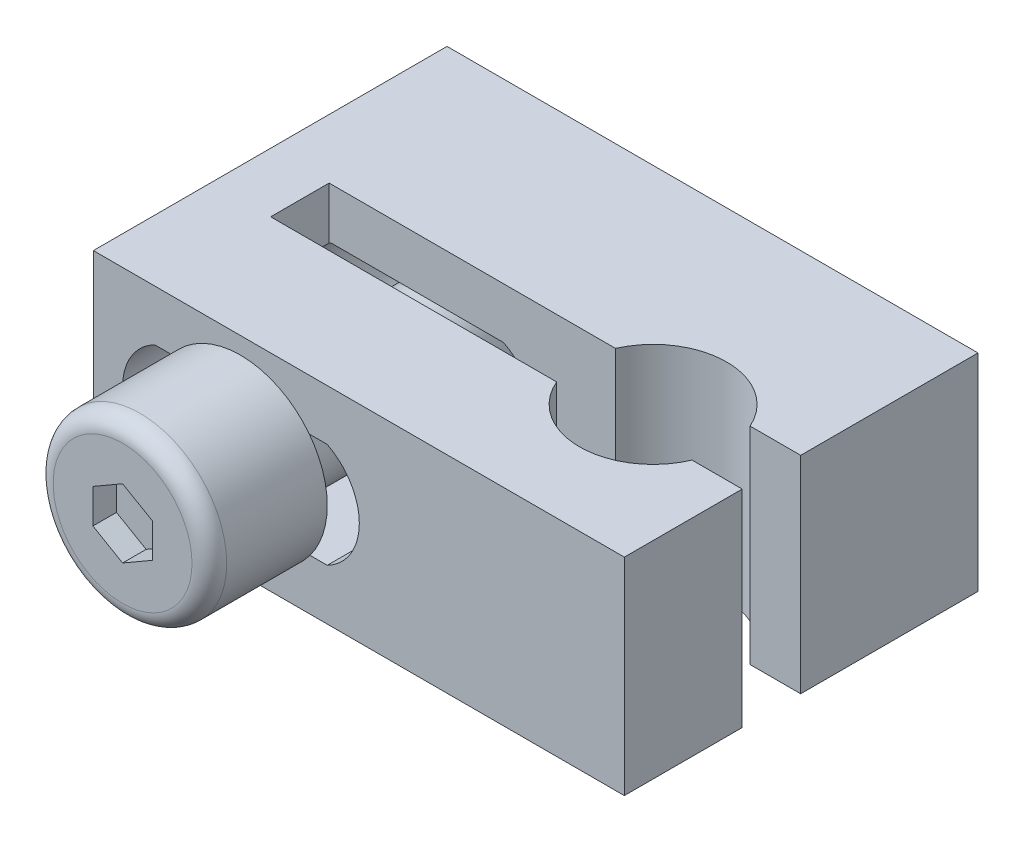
from build123d import *

# Parameters (mm, degrees)
SKETCH1_W          = 14.3002
SKETCH1_H          = 5.5626
EXTRUDE1_DEPTH     = 9.525
CUT_EXTRUDE1_DEPTH = 9.525
CUT_EXTRUDE2_DEPTH = 5.5626
CUT_EXTRUDE3_DEPTH = 1.5875


with BuildPart() as part:
    # Sketch1 → Extrude1 (new body)
    with BuildSketch(Plane.XY.offset(-4.7625)):
        Rectangle(SKETCH1_W, SKETCH1_H)
    extrude(amount=EXTRUDE1_DEPTH)

    # Sketch2 → Cut-Extrude1 (cut)
    with BuildSketch(Plane.XY.offset(-4.7625)):
        with BuildLine():
            Line((-5.4991, -1.4097), (-0.8509, -1.4097))
            ThreePointArc((-0.8509, -1.4097), (0.0127, 0), (-0.8509, 1.4097))
            Line((-0.8509, 1.4097), (-5.4991, 1.4097))
            ThreePointArc((-5.4991, 1.4097), (-6.3627, 0), (-5.4991, -1.4097))
        make_face()
    extrude(amount=CUT_EXTRUDE1_DEPTH, mode=Mode.SUBTRACT)

    # Sketch3 → Cut-Extrude2 (cut)
    with BuildSketch(Plane(origin=(0, -2.7813, 0), x_dir=(-1, 0, 0), z_dir=(0, 1, 0))):
        with BuildLine():
            Line((5.5499, 0.0127), (5.5499, 1.5875))
            Line((5.5499, 1.5875), (-2.151643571, 1.5875))
            ThreePointArc((-2.151643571, 1.5875), (-3.9751, 2.794), (-5.798556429, 1.5875))
            Line((-5.798556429, 1.5875), (-7.1501, 1.5875))
            Line((-7.1501, 1.5875), (-7.1501, 0.0127))
            Line((-7.1501, 0.0127), (-5.787555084, 0.0127))
            ThreePointArc((-5.787555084, 0.0127), (-3.9751, -1.1684), (-2.162644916, 0.0127))
            Line((-2.162644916, 0.0127), (5.5499, 0.0127))
        make_face()
    extrude(amount=CUT_EXTRUDE2_DEPTH, mode=Mode.SUBTRACT)

    # Sketch4 → Revolve1 (revolve)
    with BuildSketch(Plane(origin=(0, -0.0127, 0), x_dir=(-1, 0, 0), z_dir=(0, 1, 0)), mode=Mode.PRIVATE) as revolve1_sk:
        with BuildLine():
            Line((3.1877, 7.9375), (5.05714, 7.9375))
            ThreePointArc((5.05714, 7.9375), (5.387613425, 7.800613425), (5.5245, 7.47014))
            Line((5.5245, 7.47014), (5.5245, 4.7625))
            Line((5.5245, 4.7625), (4.530271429, 4.7625))
            Line((4.530271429, 4.7625), (4.530271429, -4.7625))
            Line((4.530271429, -4.7625), (3.1877, -4.7625))
            Line((3.1877, -4.7625), (3.1877, 7.9375))
        make_face()
    revolve(revolve1_sk.sketch.rotate(Axis((-3.1877, -0.0127, -4.7625), (0, 0, 1)), 180), axis=Axis((-3.1877, -0.0127, -4.7625), (0, 0, 1)))

    # Sketch5 → Cut-Extrude3 (cut)
    with BuildSketch(Plane.XY.offset(7.3025)):
        Polygon((-3.9878, 0.44923795), (-3.9878, -0.47463795), (-3.1877, -0.936575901), (-2.3876, -0.47463795), (-2.3876, 0.44923795), (-3.1877, 0.911175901), align=None)
    extrude(amount=CUT_EXTRUDE3_DEPTH, mode=Mode.SUBTRACT)


solid = part.part
